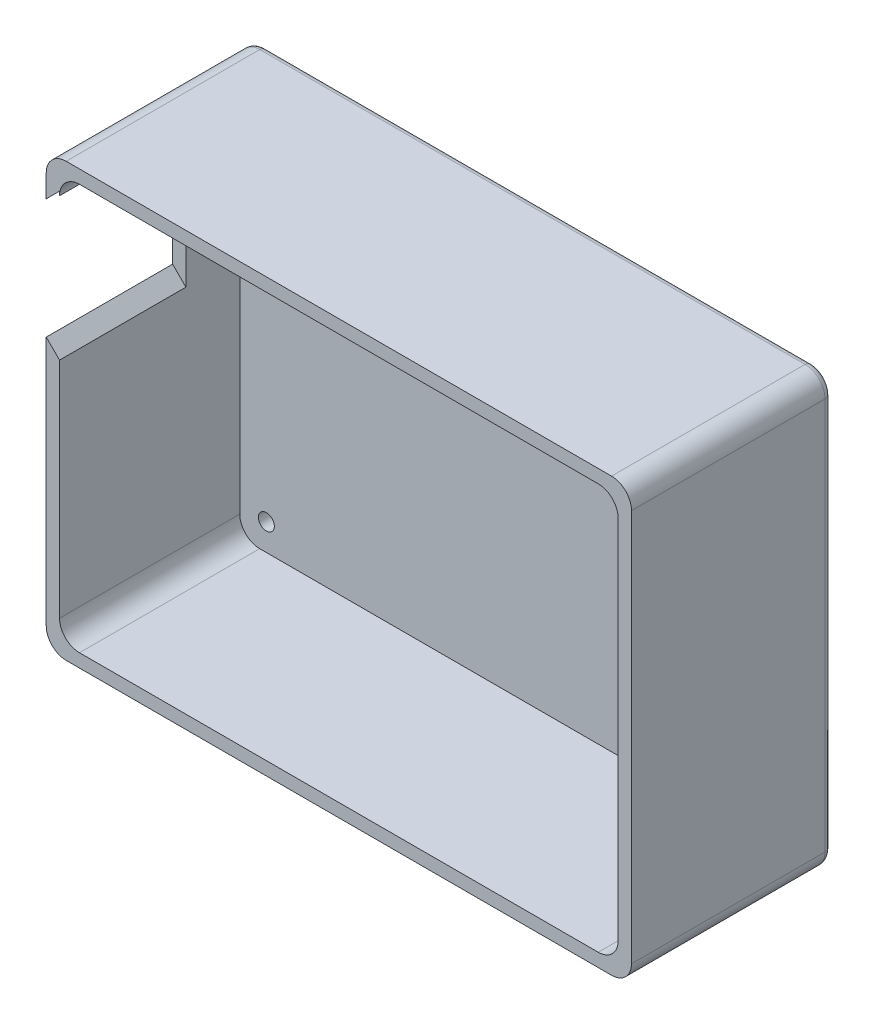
from build123d import *

# Parameters (mm, degrees)
EXTRUDE_BASE_DEPTH                              = 3
EXTEND_BASE_DEPTH                               = 3
CSK_FOR_M2_FLAT_HEAD_MACHINE_SCREW1_D           = 2.4
CSK_FOR_M2_FLAT_HEAD_MACHINE_SCREW1_CSINK_D     = 4.4
CSK_FOR_M2_FLAT_HEAD_MACHINE_SCREW1_CSINK_ANGLE = 90
SMOOTH_THE_TOP_R                                = 1
BUILD_THE_WALL_DEPTH                            = 27.1
WIRE_ESCAPE_DEPTH                               = 19


with BuildPart() as part:
    # Base Footprint → Extrude Base (new body)
    with BuildSketch(Plane.XY):
        with BuildLine():
            Line((3, 0), (79, 0))
            ThreePointArc((79, 0), (81.121320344, 0.878679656), (82, 3))
            Line((82, 3), (82, 56))
            ThreePointArc((82, 56), (81.121320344, 58.121320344), (79, 59))
            Line((79, 59), (3, 59))
            ThreePointArc((3, 59), (0.878679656, 58.121320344), (0, 56))
            Line((0, 56), (0, 3))
            ThreePointArc((0, 3), (0.878679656, 0.878679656), (3, 0))
        make_face()
    extrude(amount=EXTRUDE_BASE_DEPTH)

    # Extended Base Footprint → Extend Base (add)
    with BuildSketch(Plane(origin=(0, 0, 0), x_dir=(-1, 0, 0), z_dir=(0, 0, -1))):
        with BuildLine():
            Line((-82, 62), (0, 62))
            ThreePointArc((0, 62), (2.121320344, 61.121320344), (3, 59))
            Line((3, 59), (3, 0))
            ThreePointArc((3, 0), (2.121320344, -2.121320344), (0, -3))
            Line((0, -3), (-82, -3))
            ThreePointArc((-82, -3), (-84.121320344, -2.121320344), (-85, 0))
            Line((-85, 0), (-85, 59))
            ThreePointArc((-85, 59), (-84.121320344, 61.121320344), (-82, 62))
        make_face()
    extrude(amount=-EXTEND_BASE_DEPTH)

    # CSK for M2 Flat Head Machine Screw1 (through all)
    with Locations(Plane(origin=(0, 0, 0), x_dir=(-1, 0, 0), z_dir=(0, 0, -1))):
        with Locations((-79, 56), (-3, 56), (-3, 3), (-79, 3)):
            CounterSinkHole(CSK_FOR_M2_FLAT_HEAD_MACHINE_SCREW1_D / 2, CSK_FOR_M2_FLAT_HEAD_MACHINE_SCREW1_CSINK_D / 2, counter_sink_angle=CSK_FOR_M2_FLAT_HEAD_MACHINE_SCREW1_CSINK_ANGLE)

    # Smooth the top
    smooth_the_top_edges = [part.edges().sort_by_distance(p)[0] for p in [
        (84.121320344, -2.121320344, 0),
        (41, -3, 0),
        (-2.121320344, -2.121320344, 0),
        (-3, 29.5, 0),
        (-2.121320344, 61.121320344, 0),
        (41, 62, 0),
        (84.121320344, 61.121320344, 0),
        (85, 29.5, 0),
    ]]
    fillet(smooth_the_top_edges, radius=SMOOTH_THE_TOP_R)

    # Wall Outline → Build the wall (add)
    with BuildSketch(Plane.XY.offset(3)):
        with BuildLine():
            Line((82, -3), (0, -3))
            ThreePointArc((0, -3), (-2.121320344, -2.121320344), (-3, 0))
            Line((-3, 0), (-3, 59))
            ThreePointArc((-3, 59), (-2.121320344, 61.121320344), (0, 62))
            Line((0, 62), (82, 62))
            ThreePointArc((82, 62), (84.121320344, 61.121320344), (85, 59))
            Line((85, 59), (85, 0))
            ThreePointArc((85, 0), (84.121320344, -2.121320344), (82, -3))
        make_face()
        with BuildLine():
            Line((80, -1), (2, -1))
            ThreePointArc((2, -1), (-0.121320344, -0.121320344), (-1, 2))
            Line((-1, 2), (-1, 57))
            ThreePointArc((-1, 57), (-0.121320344, 59.121320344), (2, 60))
            Line((2, 60), (80, 60))
            ThreePointArc((80, 60), (82.121320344, 59.121320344), (83, 57))
            Line((83, 57), (83, 2))
            ThreePointArc((83, 2), (82.121320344, -0.121320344), (80, -1))
        make_face(mode=Mode.SUBTRACT)
    extrude(amount=BUILD_THE_WALL_DEPTH)

    # Wire Escape Footprint → Wire Escape (cut)
    with BuildSketch(Plane.XY.offset(30.1)):
        Polygon((-3, 55.60496316), (-3, 37.60496316), (-1, 35.60496316), (-1, 57.60496316), align=None)
    extrude(amount=-WIRE_ESCAPE_DEPTH, mode=Mode.SUBTRACT)


solid = part.part
